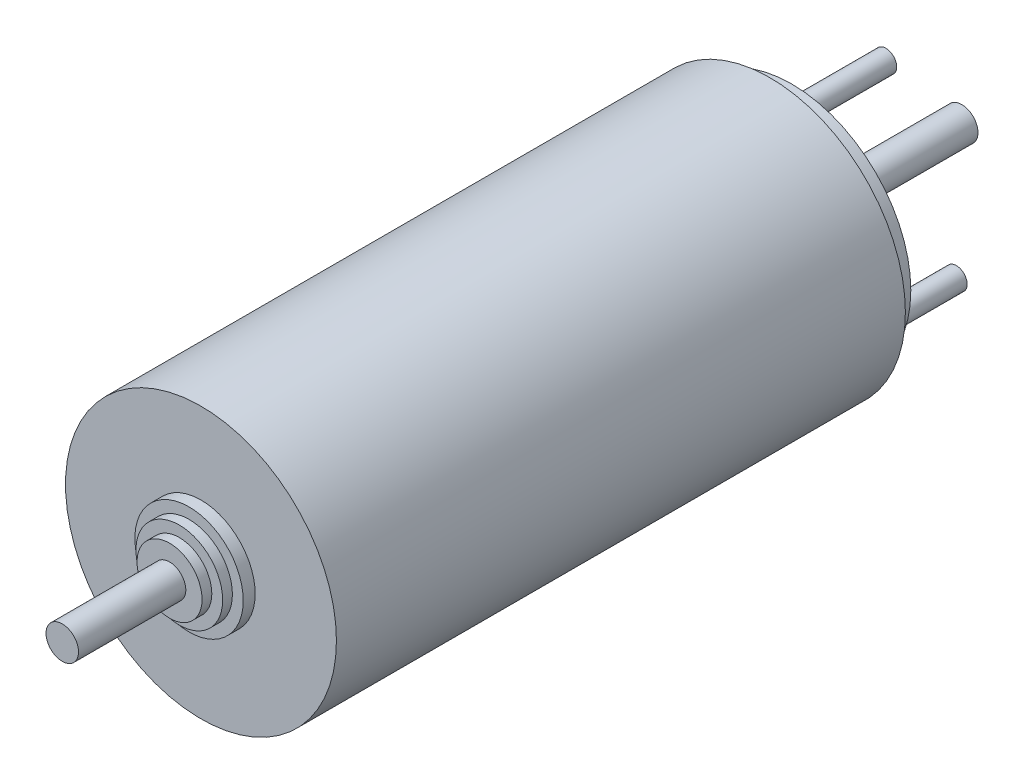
from build123d import *

# Parameters (mm, degrees)
SKETCH1_R            = 12.5
BOSS_EXTRUDE1_DEPTH  = 52.5
SKETCH2_R            = 5
BOSS_EXTRUDE2_DEPTH  = 1.1
SKETCH3_R            = 4
BOSS_EXTRUDE3_DEPTH  = 0.9
SKETCH4_R            = 3
BOSS_EXTRUDE4_DEPTH  = 0.9
SKETCH5_R            = 1.5
BOSS_EXTRUDE5_DEPTH  = 9.9
SKETCH6_R            = 11
BOSS_EXTRUDE6_DEPTH  = 2
BOSS_EXTRUDE7_START  = 1.35
SKETCH7_R            = 4
BOSS_EXTRUDE7_DEPTH  = 1.35
BOSS_EXTRUDE8_START  = 1.35
SKETCH8_R            = 3
BOSS_EXTRUDE8_DEPTH  = 1.35
BOSS_EXTRUDE9_START  = 13
SKETCH9_R            = 1.5
BOSS_EXTRUDE9_DEPTH  = 13
SKETCH10_R           = 1
BOSS_EXTRUDE10_DEPTH = 8.7


with BuildPart() as part:
    # Sketch1 → Boss-Extrude1 (new body)
    with BuildSketch(Plane.XY):
        with Locations((-5.370385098, 6.897259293)):
            Circle(SKETCH1_R)
    extrude(amount=BOSS_EXTRUDE1_DEPTH)

    # Sketch2 → Boss-Extrude2 (add)
    with BuildSketch(Plane.XY.offset(52.5)):
        with Locations((-5.370385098, 6.897259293)):
            Circle(SKETCH2_R)
    extrude(amount=BOSS_EXTRUDE2_DEPTH)

    # Sketch3 → Boss-Extrude3 (add)
    with BuildSketch(Plane.XY.offset(53.6)):
        with Locations((-5.370385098, 6.897259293)):
            Circle(SKETCH3_R)
    extrude(amount=BOSS_EXTRUDE3_DEPTH)

    # Sketch4 → Boss-Extrude4 (add)
    with BuildSketch(Plane.XY.offset(54.5)):
        with Locations((-5.370385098, 6.897259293)):
            Circle(SKETCH4_R)
    extrude(amount=BOSS_EXTRUDE4_DEPTH)

    # Sketch5 → Boss-Extrude5 (add)
    with BuildSketch(Plane.XY.offset(55.4)):
        with Locations(Location((-5.370385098, 6.897259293, 0), (0, 0, 180))):
            Circle(SKETCH5_R)
    extrude(amount=BOSS_EXTRUDE5_DEPTH)

    # Sketch6 → Boss-Extrude6 (add)
    with BuildSketch(Plane(origin=(0, 0, 0), x_dir=(-1, 0, 0), z_dir=(0, 0, -1))):
        with Locations(Location((5.370385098, 6.897259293, 0), (0, 0, 180))):
            Circle(SKETCH6_R)
    extrude(amount=BOSS_EXTRUDE6_DEPTH)

    # Sketch7 → Boss-Extrude7 (add)
    with BuildSketch(Plane(origin=(0, 0, -2), x_dir=(-1, 0, 0), z_dir=(0, 0, -1)).offset(BOSS_EXTRUDE7_START)):
        with Locations(Location((5.370385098, 6.897259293, 0), (0, 0, 180))):
            Circle(SKETCH7_R)
    extrude(amount=-BOSS_EXTRUDE7_DEPTH)

    # Sketch8 → Boss-Extrude8 (add)
    with BuildSketch(Plane(origin=(0, 0, -3.35), x_dir=(-1, 0, 0), z_dir=(0, 0, -1)).offset(BOSS_EXTRUDE8_START)):
        with Locations(Location((5.370385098, 6.897259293, 0), (0, 0, 180))):
            Circle(SKETCH8_R)
    extrude(amount=-BOSS_EXTRUDE8_DEPTH)

    # Sketch9 → Boss-Extrude9 (add)
    with BuildSketch(Plane(origin=(0, 0, -4.7), x_dir=(-1, 0, 0), z_dir=(0, 0, -1)).offset(BOSS_EXTRUDE9_START)):
        with Locations((5.370385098, 6.897259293)):
            Circle(SKETCH9_R)
    extrude(amount=-BOSS_EXTRUDE9_DEPTH)

    # Sketch10 → Boss-Extrude10 (add)
    with BuildSketch(Plane(origin=(0, 0, -2), x_dir=(-1, 0, 0), z_dir=(0, 0, -1))):
        with Locations((5.370564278, 15.397259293)):
            Circle(SKETCH10_R)
        with Locations((11.870564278, 1.280849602)):
            Circle(SKETCH10_R)
        with Locations((-1.129435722, 1.280849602)):
            Circle(SKETCH10_R)
    extrude(amount=BOSS_EXTRUDE10_DEPTH)


solid = part.part
